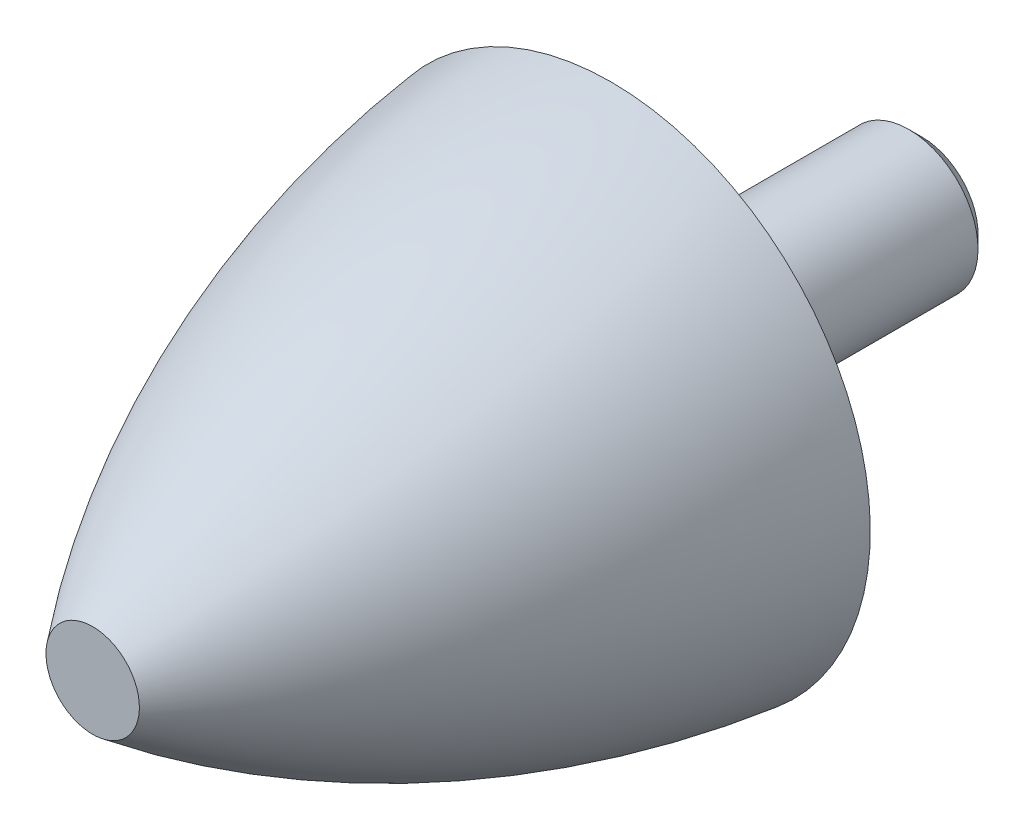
ISO-10303-21;
HEADER;
FILE_DESCRIPTION(('STEP AP214'),'2;1');
FILE_NAME('part.step','',(''),(''),'','','');
FILE_SCHEMA(('AUTOMOTIVE_DESIGN { 1 0 10303 214 1 1 1 1 }'));
ENDSEC;
DATA;
#1=APPLICATION_CONTEXT('core data for automotive mechanical design processes');
#2=APPLICATION_PROTOCOL_DEFINITION('international standard','automotive_design',2000,#1);
#3=PRODUCT_CONTEXT('',#1,'mechanical');
#4=PRODUCT('Part','Part','',(#3));
#5=PRODUCT_RELATED_PRODUCT_CATEGORY('part','',(#4));
#6=PRODUCT_DEFINITION_FORMATION('','',#4);
#7=PRODUCT_DEFINITION_CONTEXT('part definition',#1,'design');
#8=PRODUCT_DEFINITION('design','',#6,#7);
#9=PRODUCT_DEFINITION_SHAPE('','',#8);
#10=(LENGTH_UNIT() NAMED_UNIT(*) SI_UNIT(.MILLI.,.METRE.));
#11=(NAMED_UNIT(*) PLANE_ANGLE_UNIT() SI_UNIT($,.RADIAN.));
#12=(NAMED_UNIT(*) SI_UNIT($,.STERADIAN.) SOLID_ANGLE_UNIT());
#13=UNCERTAINTY_MEASURE_WITH_UNIT(LENGTH_MEASURE(1.E-05),#10,'distance_accuracy_value','');
#14=(GEOMETRIC_REPRESENTATION_CONTEXT(3) GLOBAL_UNCERTAINTY_ASSIGNED_CONTEXT((#13)) GLOBAL_UNIT_ASSIGNED_CONTEXT((#10,
#11,#12)) REPRESENTATION_CONTEXT('',''));
#15=CARTESIAN_POINT('',(0.,0.,0.));
#16=DIRECTION('',(0.,0.,1.));
#17=DIRECTION('',(1.,0.,0.));
#18=AXIS2_PLACEMENT_3D('',#15,#16,#17);
#19=CARTESIAN_POINT('',(15.,0.,0.));
#20=DIRECTION('',(0.,0.,1.));
#21=DIRECTION('',(0.,-1.,0.));
#22=AXIS2_PLACEMENT_3D('',#19,#20,#21);
#23=PLANE('',#22);
#24=CARTESIAN_POINT('',(0.,0.,0.));
#25=DIRECTION('',(0.,0.,-1.));
#26=DIRECTION('',(0.,1.,0.));
#27=AXIS2_PLACEMENT_3D('',#24,#25,#26);
#28=CIRCLE('',#27,4.);
#29=CARTESIAN_POINT('',(0.,4.,0.));
#30=VERTEX_POINT('',#29);
#31=EDGE_CURVE('E23',#30,#30,#28,.T.);
#32=ORIENTED_EDGE('',*,*,#31,.F.);
#33=EDGE_LOOP('',(#32));
#34=FACE_BOUND('',#33,.T.);
#35=CARTESIAN_POINT('',(0.,0.,0.));
#36=DIRECTION('',(0.,0.,-1.));
#37=DIRECTION('',(0.,1.,0.));
#38=AXIS2_PLACEMENT_3D('',#35,#36,#37);
#39=CIRCLE('',#38,15.);
#40=CARTESIAN_POINT('',(0.,15.,0.));
#41=VERTEX_POINT('',#40);
#42=EDGE_CURVE('E19',#41,#41,#39,.T.);
#43=ORIENTED_EDGE('',*,*,#42,.T.);
#44=EDGE_LOOP('',(#43));
#45=FACE_BOUND('',#44,.T.);
#46=ADVANCED_FACE('F12',(#34,#45),#23,.F.);
#47=CARTESIAN_POINT('',(0.,0.,30.));
#48=DIRECTION('',(0.,0.,-1.));
#49=DIRECTION('',(0.,1.,0.));
#50=AXIS2_PLACEMENT_3D('',#47,#48,#49);
#51=PLANE('',#50);
#52=CARTESIAN_POINT('',(0.,0.,30.));
#53=DIRECTION('',(0.,0.,-1.));
#54=DIRECTION('',(0.,1.,0.));
#55=AXIS2_PLACEMENT_3D('',#52,#53,#54);
#56=CIRCLE('',#55,2.7027027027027);
#57=CARTESIAN_POINT('',(0.,2.7027027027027,30.));
#58=VERTEX_POINT('',#57);
#59=EDGE_CURVE('E8',#58,#58,#56,.T.);
#60=ORIENTED_EDGE('',*,*,#59,.F.);
#61=EDGE_LOOP('',(#60));
#62=FACE_BOUND('',#61,.T.);
#63=ADVANCED_FACE('F14',(#62),#51,.F.);
#64=CARTESIAN_POINT('',(0.,0.,-6.91052948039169));
#65=DIRECTION('',(0.,0.,-1.));
#66=DIRECTION('',(0.,1.,0.));
#67=AXIS2_PLACEMENT_3D('',#64,#65,#66);
#68=DEGENERATE_TOROIDAL_SURFACE('',#67,44.600709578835,60.,.F.);
#69=ORIENTED_EDGE('',*,*,#59,.T.);
#70=EDGE_LOOP('',(#69));
#71=FACE_BOUND('',#70,.T.);
#72=ORIENTED_EDGE('',*,*,#42,.F.);
#73=EDGE_LOOP('',(#72));
#74=FACE_BOUND('',#73,.T.);
#75=ADVANCED_FACE('F47',(#71,#74),#68,.F.);
#76=CARTESIAN_POINT('',(0.,0.,-18.));
#77=DIRECTION('',(0.,0.,-1.));
#78=DIRECTION('',(0.,1.,0.));
#79=AXIS2_PLACEMENT_3D('',#76,#77,#78);
#80=CYLINDRICAL_SURFACE('',#79,4.);
#81=CARTESIAN_POINT('',(0.,0.,-17.233));
#82=DIRECTION('',(0.,0.,-1.));
#83=DIRECTION('',(0.,1.,0.));
#84=AXIS2_PLACEMENT_3D('',#81,#82,#83);
#85=CIRCLE('',#84,4.);
#86=CARTESIAN_POINT('',(0.,4.,-17.233));
#87=VERTEX_POINT('',#86);
#88=EDGE_CURVE('E27',#87,#87,#85,.T.);
#89=ORIENTED_EDGE('',*,*,#88,.F.);
#90=EDGE_LOOP('',(#89));
#91=FACE_BOUND('',#90,.T.);
#92=ORIENTED_EDGE('',*,*,#31,.T.);
#93=EDGE_LOOP('',(#92));
#94=FACE_BOUND('',#93,.T.);
#95=ADVANCED_FACE('F41',(#91,#94),#80,.T.);
#96=CARTESIAN_POINT('',(0.,0.,-17.233));
#97=DIRECTION('',(0.,0.,1.));
#98=DIRECTION('',(0.,-1.,0.));
#99=AXIS2_PLACEMENT_3D('',#96,#97,#98);
#100=CONICAL_SURFACE('',#99,4.,0.785398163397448);
#101=CARTESIAN_POINT('',(0.,0.,-18.));
#102=DIRECTION('',(0.,0.,-1.));
#103=DIRECTION('',(0.,1.,0.));
#104=AXIS2_PLACEMENT_3D('',#101,#102,#103);
#105=CIRCLE('',#104,3.233);
#106=CARTESIAN_POINT('',(0.,3.233,-18.));
#107=VERTEX_POINT('',#106);
#108=EDGE_CURVE('E32',#107,#107,#105,.T.);
#109=ORIENTED_EDGE('',*,*,#108,.F.);
#110=EDGE_LOOP('',(#109));
#111=FACE_BOUND('',#110,.T.);
#112=ORIENTED_EDGE('',*,*,#88,.T.);
#113=EDGE_LOOP('',(#112));
#114=FACE_BOUND('',#113,.T.);
#115=ADVANCED_FACE('F38',(#111,#114),#100,.T.);
#116=CARTESIAN_POINT('',(3.233,0.,-18.));
#117=DIRECTION('',(0.,0.,1.));
#118=DIRECTION('',(0.,-1.,0.));
#119=AXIS2_PLACEMENT_3D('',#116,#117,#118);
#120=PLANE('',#119);
#121=ORIENTED_EDGE('',*,*,#108,.T.);
#122=EDGE_LOOP('',(#121));
#123=FACE_BOUND('',#122,.T.);
#124=ADVANCED_FACE('F36',(#123),#120,.F.);
#125=CLOSED_SHELL('',(#46,#63,#75,#95,#115,#124));
#126=MANIFOLD_SOLID_BREP('B1',#125);
#127=ADVANCED_BREP_SHAPE_REPRESENTATION('',(#18,#126),#14);
#128=SHAPE_DEFINITION_REPRESENTATION(#9,#127);
ENDSEC;
END-ISO-10303-21;
